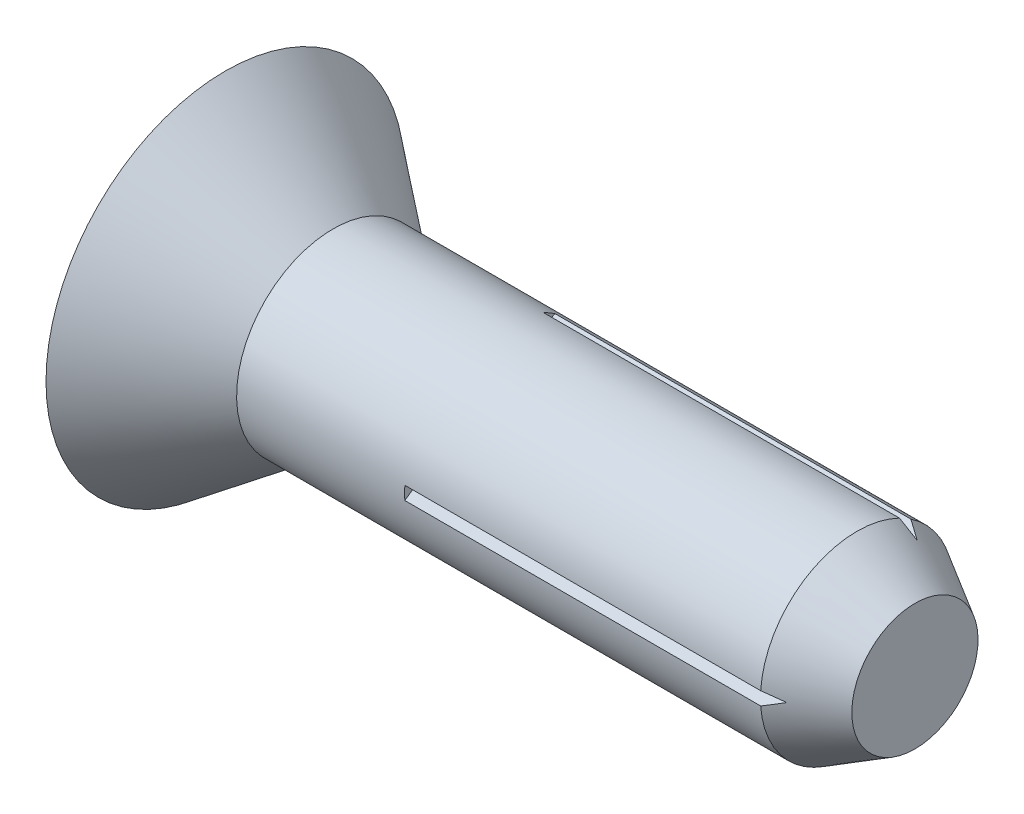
ISO-10303-21;
HEADER;
FILE_DESCRIPTION(('STEP AP214'),'2;1');
FILE_NAME('part.step','',(''),(''),'','','');
FILE_SCHEMA(('AUTOMOTIVE_DESIGN { 1 0 10303 214 1 1 1 1 }'));
ENDSEC;
DATA;
#1=APPLICATION_CONTEXT('core data for automotive mechanical design processes');
#2=APPLICATION_PROTOCOL_DEFINITION('international standard','automotive_design',2000,#1);
#3=PRODUCT_CONTEXT('',#1,'mechanical');
#4=PRODUCT('Part','Part','',(#3));
#5=PRODUCT_RELATED_PRODUCT_CATEGORY('part','',(#4));
#6=PRODUCT_DEFINITION_FORMATION('','',#4);
#7=PRODUCT_DEFINITION_CONTEXT('part definition',#1,'design');
#8=PRODUCT_DEFINITION('design','',#6,#7);
#9=PRODUCT_DEFINITION_SHAPE('','',#8);
#10=(LENGTH_UNIT() NAMED_UNIT(*) SI_UNIT(.MILLI.,.METRE.));
#11=(NAMED_UNIT(*) PLANE_ANGLE_UNIT() SI_UNIT($,.RADIAN.));
#12=(NAMED_UNIT(*) SI_UNIT($,.STERADIAN.) SOLID_ANGLE_UNIT());
#13=UNCERTAINTY_MEASURE_WITH_UNIT(LENGTH_MEASURE(1.E-05),#10,'distance_accuracy_value','');
#14=(GEOMETRIC_REPRESENTATION_CONTEXT(3) GLOBAL_UNCERTAINTY_ASSIGNED_CONTEXT((#13)) GLOBAL_UNIT_ASSIGNED_CONTEXT((#10,
#11,#12)) REPRESENTATION_CONTEXT('',''));
#15=CARTESIAN_POINT('',(0.,0.,0.));
#16=DIRECTION('',(0.,0.,1.));
#17=DIRECTION('',(1.,0.,0.));
#18=AXIS2_PLACEMENT_3D('',#15,#16,#17);
#19=CARTESIAN_POINT('',(-11.1041481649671,0.,0.));
#20=DIRECTION('',(-1.,0.,0.));
#21=DIRECTION('',(0.,-1.,0.));
#22=AXIS2_PLACEMENT_3D('',#19,#20,#21);
#23=CYLINDRICAL_SURFACE('',#22,0.7);
#24=CARTESIAN_POINT('',(2.,0.,0.));
#25=DIRECTION('',(-1.,0.,0.));
#26=DIRECTION('',(0.,-1.,0.));
#27=AXIS2_PLACEMENT_3D('',#24,#25,#26);
#28=CIRCLE('',#27,0.7);
#29=CARTESIAN_POINT('',(2.,0.62873237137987,-0.307726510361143));
#30=VERTEX_POINT('',#29);
#31=CARTESIAN_POINT('',(2.,0.580865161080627,-0.390634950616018));
#32=VERTEX_POINT('',#31);
#33=EDGE_CURVE('E112',#30,#32,#28,.T.);
#34=ORIENTED_EDGE('',*,*,#33,.T.);
#35=DIRECTION('',(-1.,0.,0.));
#36=VECTOR('',#35,1.);
#37=CARTESIAN_POINT('',(-11.1041481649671,0.580865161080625,-0.390634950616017));
#38=LINE('',#37,#36);
#39=CARTESIAN_POINT('',(4.58,0.580865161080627,-0.390634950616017));
#40=VERTEX_POINT('',#39);
#41=EDGE_CURVE('E47',#32,#40,#38,.F.);
#42=ORIENTED_EDGE('',*,*,#41,.T.);
#43=CARTESIAN_POINT('',(4.58,0.,0.));
#44=DIRECTION('',(-1.,0.,0.));
#45=DIRECTION('',(0.,-1.,0.));
#46=AXIS2_PLACEMENT_3D('',#43,#44,#45);
#47=CIRCLE('',#46,0.7);
#48=CARTESIAN_POINT('',(4.58,-0.58086516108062,-0.390634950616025));
#49=VERTEX_POINT('',#48);
#50=EDGE_CURVE('E341',#40,#49,#47,.T.);
#51=ORIENTED_EDGE('',*,*,#50,.T.);
#52=DIRECTION('',(-1.,0.,0.));
#53=VECTOR('',#52,1.);
#54=CARTESIAN_POINT('',(-11.1041481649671,-0.580865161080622,-0.390634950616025));
#55=LINE('',#54,#53);
#56=CARTESIAN_POINT('',(2.,-0.580865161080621,-0.390634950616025));
#57=VERTEX_POINT('',#56);
#58=EDGE_CURVE('E352',#49,#57,#55,.T.);
#59=ORIENTED_EDGE('',*,*,#58,.T.);
#60=CARTESIAN_POINT('',(2.,0.,0.));
#61=DIRECTION('',(-1.,0.,0.));
#62=DIRECTION('',(0.,-1.,0.));
#63=AXIS2_PLACEMENT_3D('',#60,#61,#62);
#64=CIRCLE('',#63,0.7);
#65=CARTESIAN_POINT('',(2.,-0.628732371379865,-0.307726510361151));
#66=VERTEX_POINT('',#65);
#67=EDGE_CURVE('E328',#57,#66,#64,.T.);
#68=ORIENTED_EDGE('',*,*,#67,.T.);
#69=DIRECTION('',(-1.,0.,0.));
#70=VECTOR('',#69,1.);
#71=CARTESIAN_POINT('',(-11.1041481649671,-0.628732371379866,-0.307726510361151));
#72=LINE('',#71,#70);
#73=CARTESIAN_POINT('',(4.58,-0.628732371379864,-0.307726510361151));
#74=VERTEX_POINT('',#73);
#75=EDGE_CURVE('E355',#66,#74,#72,.F.);
#76=ORIENTED_EDGE('',*,*,#75,.T.);
#77=CARTESIAN_POINT('',(4.58,-0.0478672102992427,0.698361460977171));
#78=VERTEX_POINT('',#77);
#79=EDGE_CURVE('E340',#74,#78,#47,.T.);
#80=ORIENTED_EDGE('',*,*,#79,.T.);
#81=DIRECTION('',(-1.,0.,0.));
#82=VECTOR('',#81,1.);
#83=CARTESIAN_POINT('',(-11.1041481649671,-0.0478672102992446,0.698361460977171));
#84=LINE('',#83,#82);
#85=CARTESIAN_POINT('',(2.,-0.0478672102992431,0.698361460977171));
#86=VERTEX_POINT('',#85);
#87=EDGE_CURVE('E329',#78,#86,#84,.T.);
#88=ORIENTED_EDGE('',*,*,#87,.T.);
#89=CARTESIAN_POINT('',(2.,0.,0.));
#90=DIRECTION('',(-1.,0.,0.));
#91=DIRECTION('',(0.,0.,1.));
#92=AXIS2_PLACEMENT_3D('',#89,#90,#91);
#93=CIRCLE('',#92,0.7);
#94=CARTESIAN_POINT('',(2.,0.0478672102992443,0.698361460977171));
#95=VERTEX_POINT('',#94);
#96=EDGE_CURVE('E331',#86,#95,#93,.T.);
#97=ORIENTED_EDGE('',*,*,#96,.T.);
#98=DIRECTION('',(-1.,0.,0.));
#99=VECTOR('',#98,1.);
#100=CARTESIAN_POINT('',(-11.1041481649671,0.0478672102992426,0.698361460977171));
#101=LINE('',#100,#99);
#102=CARTESIAN_POINT('',(4.58,0.0478672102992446,0.698361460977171));
#103=VERTEX_POINT('',#102);
#104=EDGE_CURVE('E324',#95,#103,#101,.F.);
#105=ORIENTED_EDGE('',*,*,#104,.T.);
#106=CARTESIAN_POINT('',(4.58,0.62873237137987,-0.307726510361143));
#107=VERTEX_POINT('',#106);
#108=EDGE_CURVE('E339',#103,#107,#47,.T.);
#109=ORIENTED_EDGE('',*,*,#108,.T.);
#110=DIRECTION('',(-1.,0.,0.));
#111=VECTOR('',#110,1.);
#112=CARTESIAN_POINT('',(-11.1041481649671,0.628732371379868,-0.307726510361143));
#113=LINE('',#112,#111);
#114=EDGE_CURVE('E358',#107,#30,#113,.T.);
#115=ORIENTED_EDGE('',*,*,#114,.T.);
#116=EDGE_LOOP('',(#34,#42,#51,#59,#68,#76,#80,#88,#97,#105,#109,#115));
#117=FACE_BOUND('',#116,.T.);
#118=CARTESIAN_POINT('',(0.781935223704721,0.,0.));
#119=DIRECTION('',(-1.,0.,0.));
#120=DIRECTION('',(0.,-1.,0.));
#121=AXIS2_PLACEMENT_3D('',#118,#119,#120);
#122=CIRCLE('',#121,0.7);
#123=CARTESIAN_POINT('',(0.781935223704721,-0.7,0.));
#124=VERTEX_POINT('',#123);
#125=EDGE_CURVE('E11',#124,#124,#122,.T.);
#126=ORIENTED_EDGE('',*,*,#125,.F.);
#127=EDGE_LOOP('',(#126));
#128=FACE_BOUND('',#127,.T.);
#129=ADVANCED_FACE('F39',(#117,#128),#23,.T.);
#130=CARTESIAN_POINT('',(5.,0.,0.));
#131=DIRECTION('',(-1.,0.,0.));
#132=DIRECTION('',(0.,-1.,0.));
#133=AXIS2_PLACEMENT_3D('',#130,#131,#132);
#134=PLANE('',#133);
#135=CARTESIAN_POINT('',(5.,0.,0.));
#136=DIRECTION('',(-1.,0.,0.));
#137=DIRECTION('',(0.,-1.,0.));
#138=AXIS2_PLACEMENT_3D('',#135,#136,#137);
#139=CIRCLE('',#138,0.457512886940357);
#140=CARTESIAN_POINT('',(5.,-0.457512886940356,0.));
#141=VERTEX_POINT('',#140);
#142=EDGE_CURVE('E344',#141,#141,#139,.T.);
#143=ORIENTED_EDGE('',*,*,#142,.F.);
#144=EDGE_LOOP('',(#143));
#145=FACE_BOUND('',#144,.T.);
#146=ADVANCED_FACE('F41',(#145),#134,.F.);
#147=CARTESIAN_POINT('',(5.,0.,0.));
#148=DIRECTION('',(-1.,0.,0.));
#149=DIRECTION('',(0.,-1.,0.));
#150=AXIS2_PLACEMENT_3D('',#147,#148,#149);
#151=CONICAL_SURFACE('',#150,0.457512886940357,0.523598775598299);
#152=ORIENTED_EDGE('',*,*,#50,.F.);
#153=CARTESIAN_POINT('',(4.5798,0.580922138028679,-0.390757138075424));
#154=CARTESIAN_POINT('',(4.60023803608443,0.575108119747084,-0.378288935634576));
#155=CARTESIAN_POINT('',(4.62060342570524,0.569249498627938,-0.365725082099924));
#156=CARTESIAN_POINT('',(4.66118897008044,0.55744303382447,-0.340406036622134));
#157=CARTESIAN_POINT('',(4.68140912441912,0.551495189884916,-0.327650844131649));
#158=CARTESIAN_POINT('',(4.70155663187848,0.545502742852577,-0.314800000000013));
#159=B_SPLINE_CURVE_WITH_KNOTS('',3,(#153,#154,#155,#156,#157,#158),.UNSPECIFIED.,.F.,.F.,(4,2,
4),(0.,0.0739074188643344,0.14781504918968),.UNSPECIFIED.);
#160=CARTESIAN_POINT('',(4.70124355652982,0.5455960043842,-0.314999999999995));
#161=VERTEX_POINT('',#160);
#162=EDGE_CURVE('E136',#40,#161,#159,.T.);
#163=ORIENTED_EDGE('',*,*,#162,.T.);
#164=CARTESIAN_POINT('',(4.70152838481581,0.545396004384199,-0.3150174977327));
#165=CARTESIAN_POINT('',(4.68138550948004,0.559517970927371,-0.31378198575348));
#166=CARTESIAN_POINT('',(4.66117002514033,0.573534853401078,-0.312555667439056));
#167=CARTESIAN_POINT('',(4.62059389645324,0.601358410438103,-0.310121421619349));
#168=CARTESIAN_POINT('',(4.60023325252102,0.615165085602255,-0.3089134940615));
#169=CARTESIAN_POINT('',(4.57980000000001,0.628866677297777,-0.307714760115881));
#170=B_SPLINE_CURVE_WITH_KNOTS('',3,(#164,#165,#166,#167,#168,#169),.UNSPECIFIED.,.F.,.F.,(4,2,
4),(0.,0.0738903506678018,0.147780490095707),.UNSPECIFIED.);
#171=EDGE_CURVE('E121',#161,#107,#170,.T.);
#172=ORIENTED_EDGE('',*,*,#171,.T.);
#173=ORIENTED_EDGE('',*,*,#108,.F.);
#174=CARTESIAN_POINT('',(4.57979999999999,0.0479445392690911,0.698471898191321));
#175=CARTESIAN_POINT('',(4.60024367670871,0.0400515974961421,0.687199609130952));
#176=CARTESIAN_POINT('',(4.62061466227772,0.0320980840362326,0.675840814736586));
#177=CARTESIAN_POINT('',(4.66121130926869,0.0160698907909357,0.652950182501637));
#178=CARTESIAN_POINT('',(4.68143697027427,0.007995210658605,0.641418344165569));
#179=CARTESIAN_POINT('',(4.7015899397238,-0.00014004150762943,0.629800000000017));
#180=B_SPLINE_CURVE_WITH_KNOTS('',3,(#174,#175,#176,#177,#178,#179),.UNSPECIFIED.,.F.,.F.,(4,2,
4),(0.,0.0739277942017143,0.147855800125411),.UNSPECIFIED.);
#181=CARTESIAN_POINT('',(4.70124355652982,0.,0.63));
#182=VERTEX_POINT('',#181);
#183=EDGE_CURVE('E194',#103,#182,#180,.T.);
#184=ORIENTED_EDGE('',*,*,#183,.T.);
#185=CARTESIAN_POINT('',(4.70158993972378,0.000140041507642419,0.6298));
#186=CARTESIAN_POINT('',(4.68143697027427,-0.00799521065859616,0.641418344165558));
#187=CARTESIAN_POINT('',(4.66121130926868,-0.0160698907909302,0.652950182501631));
#188=CARTESIAN_POINT('',(4.62061466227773,-0.032098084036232,0.675840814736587));
#189=CARTESIAN_POINT('',(4.60024367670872,-0.0400515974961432,0.687199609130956));
#190=CARTESIAN_POINT('',(4.57980000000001,-0.047944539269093,0.698471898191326));
#191=B_SPLINE_CURVE_WITH_KNOTS('',3,(#185,#186,#187,#188,#189,#190),.UNSPECIFIED.,.F.,.F.,(4,2,
4),(0.,0.0739280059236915,0.147855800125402),.UNSPECIFIED.);
#192=EDGE_CURVE('E186',#182,#78,#191,.T.);
#193=ORIENTED_EDGE('',*,*,#192,.T.);
#194=ORIENTED_EDGE('',*,*,#79,.F.);
#195=CARTESIAN_POINT('',(4.5798,-0.62886667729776,-0.307714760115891));
#196=CARTESIAN_POINT('',(4.60023325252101,-0.615165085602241,-0.308913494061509));
#197=CARTESIAN_POINT('',(4.62059389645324,-0.601358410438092,-0.310121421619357));
#198=CARTESIAN_POINT('',(4.66117002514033,-0.573534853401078,-0.312555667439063));
#199=CARTESIAN_POINT('',(4.68138550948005,-0.559517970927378,-0.313781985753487));
#200=CARTESIAN_POINT('',(4.70152838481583,-0.545396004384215,-0.315017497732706));
#201=B_SPLINE_CURVE_WITH_KNOTS('',3,(#195,#196,#197,#198,#199,#200),.UNSPECIFIED.,.F.,.F.,(4,2,
4),(0.,0.0738901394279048,0.147780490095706),.UNSPECIFIED.);
#202=CARTESIAN_POINT('',(4.70124355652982,-0.545596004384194,-0.315000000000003));
#203=VERTEX_POINT('',#202);
#204=EDGE_CURVE('E164',#74,#203,#201,.T.);
#205=ORIENTED_EDGE('',*,*,#204,.T.);
#206=CARTESIAN_POINT('',(4.70155663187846,-0.545502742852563,-0.314800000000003));
#207=CARTESIAN_POINT('',(4.68140912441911,-0.551495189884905,-0.327650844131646));
#208=CARTESIAN_POINT('',(4.66118897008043,-0.557443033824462,-0.340406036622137));
#209=CARTESIAN_POINT('',(4.62060342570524,-0.569249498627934,-0.365725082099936));
#210=CARTESIAN_POINT('',(4.60023803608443,-0.575108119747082,-0.378288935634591));
#211=CARTESIAN_POINT('',(4.57980000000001,-0.580922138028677,-0.390757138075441));
#212=B_SPLINE_CURVE_WITH_KNOTS('',3,(#206,#207,#208,#209,#210,#211),.UNSPECIFIED.,.F.,.F.,(4,2,
4),(0.,0.0739076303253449,0.147815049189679),.UNSPECIFIED.);
#213=EDGE_CURVE('E173',#203,#49,#212,.T.);
#214=ORIENTED_EDGE('',*,*,#213,.T.);
#215=EDGE_LOOP('',(#152,#163,#172,#173,#184,#193,#194,#205,#214));
#216=FACE_BOUND('',#215,.T.);
#217=ORIENTED_EDGE('',*,*,#142,.T.);
#218=EDGE_LOOP('',(#217));
#219=FACE_BOUND('',#218,.T.);
#220=ADVANCED_FACE('F143',(#216,#219),#151,.T.);
#221=CARTESIAN_POINT('',(2.,0.04901452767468,0.7));
#222=DIRECTION('',(0.,0.819152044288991,-0.573576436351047));
#223=DIRECTION('',(0.,0.573576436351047,0.819152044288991));
#224=AXIS2_PLACEMENT_3D('',#221,#222,#223);
#225=PLANE('',#224);
#226=ORIENTED_EDGE('',*,*,#104,.F.);
#227=DIRECTION('',(0.,0.573576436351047,0.819152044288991));
#228=VECTOR('',#227,1.);
#229=CARTESIAN_POINT('',(2.,0.04901452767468,0.7));
#230=LINE('',#229,#228);
#231=CARTESIAN_POINT('',(2.,0.,0.63));
#232=VERTEX_POINT('',#231);
#233=EDGE_CURVE('E180',#232,#95,#230,.T.);
#234=ORIENTED_EDGE('',*,*,#233,.F.);
#235=DIRECTION('',(1.,0.,0.));
#236=VECTOR('',#235,1.);
#237=CARTESIAN_POINT('',(2.,0.,0.63));
#238=LINE('',#237,#236);
#239=EDGE_CURVE('E183',#232,#182,#238,.T.);
#240=ORIENTED_EDGE('',*,*,#239,.T.);
#241=ORIENTED_EDGE('',*,*,#183,.F.);
#242=EDGE_LOOP('',(#226,#234,#240,#241));
#243=FACE_BOUND('',#242,.T.);
#244=ADVANCED_FACE('F205',(#243),#225,.F.);
#245=CARTESIAN_POINT('',(2.,0.,0.63));
#246=DIRECTION('',(0.,-0.819152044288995,-0.573576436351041));
#247=DIRECTION('',(0.,0.573576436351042,-0.819152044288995));
#248=AXIS2_PLACEMENT_3D('',#245,#246,#247);
#249=PLANE('',#248);
#250=ORIENTED_EDGE('',*,*,#239,.F.);
#251=DIRECTION('',(0.,0.573576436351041,-0.819152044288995));
#252=VECTOR('',#251,1.);
#253=CARTESIAN_POINT('',(2.,0.,0.63));
#254=LINE('',#253,#252);
#255=EDGE_CURVE('E172',#86,#232,#254,.T.);
#256=ORIENTED_EDGE('',*,*,#255,.F.);
#257=ORIENTED_EDGE('',*,*,#87,.F.);
#258=ORIENTED_EDGE('',*,*,#192,.F.);
#259=EDGE_LOOP('',(#250,#256,#257,#258));
#260=FACE_BOUND('',#259,.T.);
#261=ADVANCED_FACE('F201',(#260),#249,.F.);
#262=CARTESIAN_POINT('',(2.,-0.0490145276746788,0.7));
#263=DIRECTION('',(-1.,0.,0.));
#264=DIRECTION('',(0.,0.,1.));
#265=AXIS2_PLACEMENT_3D('',#262,#263,#264);
#266=PLANE('',#265);
#267=ORIENTED_EDGE('',*,*,#96,.F.);
#268=ORIENTED_EDGE('',*,*,#255,.T.);
#269=ORIENTED_EDGE('',*,*,#233,.T.);
#270=EDGE_LOOP('',(#267,#268,#269));
#271=FACE_BOUND('',#270,.T.);
#272=ADVANCED_FACE('F159',(#271),#266,.F.);
#273=CARTESIAN_POINT('',(2.,-0.630725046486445,-0.307552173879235));
#274=DIRECTION('',(0.,0.0871557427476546,0.996194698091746));
#275=DIRECTION('',(0.,-0.996194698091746,0.0871557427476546));
#276=AXIS2_PLACEMENT_3D('',#273,#274,#275);
#277=PLANE('',#276);
#278=ORIENTED_EDGE('',*,*,#75,.F.);
#279=DIRECTION('',(0.,-0.996194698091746,0.0871557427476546));
#280=VECTOR('',#279,1.);
#281=CARTESIAN_POINT('',(2.,-0.630725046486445,-0.307552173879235));
#282=LINE('',#281,#280);
#283=CARTESIAN_POINT('',(2.,-0.545596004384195,-0.315000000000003));
#284=VERTEX_POINT('',#283);
#285=EDGE_CURVE('E62',#284,#66,#282,.T.);
#286=ORIENTED_EDGE('',*,*,#285,.F.);
#287=DIRECTION('',(1.,0.,0.));
#288=VECTOR('',#287,1.);
#289=CARTESIAN_POINT('',(2.,-0.545596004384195,-0.315000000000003));
#290=LINE('',#289,#288);
#291=EDGE_CURVE('E363',#284,#203,#290,.T.);
#292=ORIENTED_EDGE('',*,*,#291,.T.);
#293=ORIENTED_EDGE('',*,*,#204,.F.);
#294=EDGE_LOOP('',(#278,#286,#292,#293));
#295=FACE_BOUND('',#294,.T.);
#296=ADVANCED_FACE('F155',(#295),#277,.F.);
#297=CARTESIAN_POINT('',(2.,-0.545596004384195,-0.315000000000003));
#298=DIRECTION('',(0.,0.906307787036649,-0.4226182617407));
#299=DIRECTION('',(0.,0.4226182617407,0.906307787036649));
#300=AXIS2_PLACEMENT_3D('',#297,#298,#299);
#301=PLANE('',#300);
#302=ORIENTED_EDGE('',*,*,#291,.F.);
#303=DIRECTION('',(0.,0.4226182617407,0.90630778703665));
#304=VECTOR('',#303,1.);
#305=CARTESIAN_POINT('',(2.,-0.545596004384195,-0.315000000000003));
#306=LINE('',#305,#304);
#307=EDGE_CURVE('E364',#57,#284,#306,.T.);
#308=ORIENTED_EDGE('',*,*,#307,.F.);
#309=ORIENTED_EDGE('',*,*,#58,.F.);
#310=ORIENTED_EDGE('',*,*,#213,.F.);
#311=EDGE_LOOP('',(#302,#308,#309,#310));
#312=FACE_BOUND('',#311,.T.);
#313=ADVANCED_FACE('F154',(#312),#301,.F.);
#314=CARTESIAN_POINT('',(2.,-0.581710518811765,-0.39244782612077));
#315=DIRECTION('',(-1.,0.,0.));
#316=DIRECTION('',(0.,-0.866025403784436,-0.500000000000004));
#317=AXIS2_PLACEMENT_3D('',#314,#315,#316);
#318=PLANE('',#317);
#319=ORIENTED_EDGE('',*,*,#307,.T.);
#320=ORIENTED_EDGE('',*,*,#285,.T.);
#321=ORIENTED_EDGE('',*,*,#67,.F.);
#322=EDGE_LOOP('',(#319,#320,#321));
#323=FACE_BOUND('',#322,.T.);
#324=ADVANCED_FACE('F151',(#323),#318,.F.);
#325=CARTESIAN_POINT('',(2.,0.581710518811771,-0.392447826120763));
#326=DIRECTION('',(0.,-0.906307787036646,-0.422618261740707));
#327=DIRECTION('',(0.,0.422618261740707,-0.906307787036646));
#328=AXIS2_PLACEMENT_3D('',#325,#326,#327);
#329=PLANE('',#328);
#330=ORIENTED_EDGE('',*,*,#41,.F.);
#331=DIRECTION('',(0.,0.422618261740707,-0.906307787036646));
#332=VECTOR('',#331,1.);
#333=CARTESIAN_POINT('',(2.,0.581710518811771,-0.392447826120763));
#334=LINE('',#333,#332);
#335=CARTESIAN_POINT('',(2.,0.5455960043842,-0.314999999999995));
#336=VERTEX_POINT('',#335);
#337=EDGE_CURVE('E54',#336,#32,#334,.T.);
#338=ORIENTED_EDGE('',*,*,#337,.F.);
#339=DIRECTION('',(1.,0.,0.));
#340=VECTOR('',#339,1.);
#341=CARTESIAN_POINT('',(2.,0.5455960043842,-0.314999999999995));
#342=LINE('',#341,#340);
#343=EDGE_CURVE('E118',#336,#161,#342,.T.);
#344=ORIENTED_EDGE('',*,*,#343,.T.);
#345=ORIENTED_EDGE('',*,*,#162,.F.);
#346=EDGE_LOOP('',(#330,#338,#344,#345));
#347=FACE_BOUND('',#346,.T.);
#348=ADVANCED_FACE('F125',(#347),#329,.F.);
#349=CARTESIAN_POINT('',(2.,0.5455960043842,-0.314999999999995));
#350=DIRECTION('',(0.,-0.0871557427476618,0.996194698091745));
#351=DIRECTION('',(0.,-0.996194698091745,-0.0871557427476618));
#352=AXIS2_PLACEMENT_3D('',#349,#350,#351);
#353=PLANE('',#352);
#354=ORIENTED_EDGE('',*,*,#343,.F.);
#355=DIRECTION('',(0.,-0.996194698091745,-0.0871557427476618));
#356=VECTOR('',#355,1.);
#357=CARTESIAN_POINT('',(2.,0.5455960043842,-0.314999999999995));
#358=LINE('',#357,#356);
#359=EDGE_CURVE('E108',#30,#336,#358,.T.);
#360=ORIENTED_EDGE('',*,*,#359,.F.);
#361=ORIENTED_EDGE('',*,*,#114,.F.);
#362=ORIENTED_EDGE('',*,*,#171,.F.);
#363=EDGE_LOOP('',(#354,#360,#361,#362));
#364=FACE_BOUND('',#363,.T.);
#365=ADVANCED_FACE('F119',(#364),#353,.F.);
#366=CARTESIAN_POINT('',(2.,0.63072504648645,-0.307552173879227));
#367=DIRECTION('',(-1.,0.,0.));
#368=DIRECTION('',(0.,0.866025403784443,-0.499999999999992));
#369=AXIS2_PLACEMENT_3D('',#366,#367,#368);
#370=PLANE('',#369);
#371=ORIENTED_EDGE('',*,*,#359,.T.);
#372=ORIENTED_EDGE('',*,*,#337,.T.);
#373=ORIENTED_EDGE('',*,*,#33,.F.);
#374=EDGE_LOOP('',(#371,#372,#373));
#375=FACE_BOUND('',#374,.T.);
#376=ADVANCED_FACE('F110',(#375),#370,.F.);
#377=CARTESIAN_POINT('',(0.781935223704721,0.,0.));
#378=DIRECTION('',(-1.,0.,0.));
#379=DIRECTION('',(0.,-1.,0.));
#380=AXIS2_PLACEMENT_3D('',#377,#378,#379);
#381=CONICAL_SURFACE('',#380,0.7,0.654498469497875);
#382=CARTESIAN_POINT('',(0.,0.,0.));
#383=DIRECTION('',(-1.,0.,0.));
#384=DIRECTION('',(0.,-1.,0.));
#385=AXIS2_PLACEMENT_3D('',#382,#383,#384);
#386=CIRCLE('',#385,1.3);
#387=CARTESIAN_POINT('',(0.,-1.3,0.));
#388=VERTEX_POINT('',#387);
#389=EDGE_CURVE('E115',#388,#388,#386,.T.);
#390=ORIENTED_EDGE('',*,*,#389,.F.);
#391=EDGE_LOOP('',(#390));
#392=FACE_BOUND('',#391,.T.);
#393=ORIENTED_EDGE('',*,*,#125,.T.);
#394=EDGE_LOOP('',(#393));
#395=FACE_BOUND('',#394,.T.);
#396=ADVANCED_FACE('F210',(#392,#395),#381,.T.);
#397=CARTESIAN_POINT('',(0.,0.700000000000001,0.));
#398=DIRECTION('',(1.,0.,0.));
#399=DIRECTION('',(0.,1.,0.));
#400=AXIS2_PLACEMENT_3D('',#397,#398,#399);
#401=PLANE('',#400);
#402=ORIENTED_EDGE('',*,*,#389,.T.);
#403=EDGE_LOOP('',(#402));
#404=FACE_BOUND('',#403,.T.);
#405=ADVANCED_FACE('F208',(#404),#401,.F.);
#406=CLOSED_SHELL('',(#129,#146,#220,#244,#261,#272,#296,#313,#324,#348,#365,#376,#396,#405));
#407=MANIFOLD_SOLID_BREP('B2',#406);
#408=ADVANCED_BREP_SHAPE_REPRESENTATION('',(#18,#407),#14);
#409=SHAPE_DEFINITION_REPRESENTATION(#9,#408);
ENDSEC;
END-ISO-10303-21;
